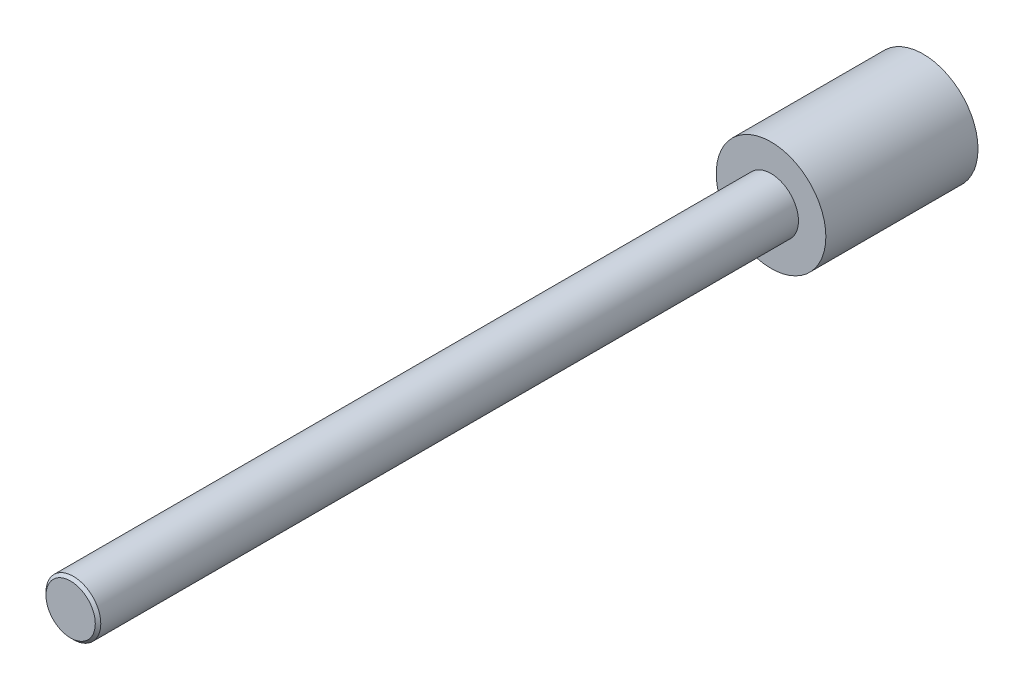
ISO-10303-21;
HEADER;
FILE_DESCRIPTION(('STEP AP214'),'2;1');
FILE_NAME('part.step','',(''),(''),'','','');
FILE_SCHEMA(('AUTOMOTIVE_DESIGN { 1 0 10303 214 1 1 1 1 }'));
ENDSEC;
DATA;
#1=APPLICATION_CONTEXT('core data for automotive mechanical design processes');
#2=APPLICATION_PROTOCOL_DEFINITION('international standard','automotive_design',2000,#1);
#3=PRODUCT_CONTEXT('',#1,'mechanical');
#4=PRODUCT('Part','Part','',(#3));
#5=PRODUCT_RELATED_PRODUCT_CATEGORY('part','',(#4));
#6=PRODUCT_DEFINITION_FORMATION('','',#4);
#7=PRODUCT_DEFINITION_CONTEXT('part definition',#1,'design');
#8=PRODUCT_DEFINITION('design','',#6,#7);
#9=PRODUCT_DEFINITION_SHAPE('','',#8);
#10=(LENGTH_UNIT() NAMED_UNIT(*) SI_UNIT(.MILLI.,.METRE.));
#11=(NAMED_UNIT(*) PLANE_ANGLE_UNIT() SI_UNIT($,.RADIAN.));
#12=(NAMED_UNIT(*) SI_UNIT($,.STERADIAN.) SOLID_ANGLE_UNIT());
#13=UNCERTAINTY_MEASURE_WITH_UNIT(LENGTH_MEASURE(1.E-05),#10,'distance_accuracy_value','');
#14=(GEOMETRIC_REPRESENTATION_CONTEXT(3) GLOBAL_UNCERTAINTY_ASSIGNED_CONTEXT((#13)) GLOBAL_UNIT_ASSIGNED_CONTEXT((#10,
#11,#12)) REPRESENTATION_CONTEXT('',''));
#15=CARTESIAN_POINT('',(0.,0.,0.));
#16=DIRECTION('',(0.,0.,1.));
#17=DIRECTION('',(1.,0.,0.));
#18=AXIS2_PLACEMENT_3D('',#15,#16,#17);
#19=CARTESIAN_POINT('',(0.,0.,13.843));
#20=DIRECTION('',(0.,0.,1.));
#21=DIRECTION('',(1.,0.,0.));
#22=AXIS2_PLACEMENT_3D('',#19,#20,#21);
#23=PLANE('',#22);
#24=CARTESIAN_POINT('',(0.,0.,13.843));
#25=DIRECTION('',(0.,0.,1.));
#26=DIRECTION('',(1.,0.,0.));
#27=AXIS2_PLACEMENT_3D('',#24,#25,#26);
#28=CIRCLE('',#27,5.08);
#29=CARTESIAN_POINT('',(5.08,0.,13.843));
#30=VERTEX_POINT('',#29);
#31=EDGE_CURVE('E45',#30,#30,#28,.T.);
#32=ORIENTED_EDGE('',*,*,#31,.T.);
#33=EDGE_LOOP('',(#32));
#34=FACE_BOUND('',#33,.T.);
#35=CARTESIAN_POINT('',(0.,0.,13.843));
#36=DIRECTION('',(0.,0.,1.));
#37=DIRECTION('',(1.,0.,0.));
#38=AXIS2_PLACEMENT_3D('',#35,#36,#37);
#39=CIRCLE('',#38,2.54);
#40=CARTESIAN_POINT('',(2.54,0.,13.843));
#41=VERTEX_POINT('',#40);
#42=EDGE_CURVE('E41',#41,#41,#39,.T.);
#43=ORIENTED_EDGE('',*,*,#42,.F.);
#44=EDGE_LOOP('',(#43));
#45=FACE_BOUND('',#44,.T.);
#46=ADVANCED_FACE('F30',(#34,#45),#23,.T.);
#47=CARTESIAN_POINT('',(0.,0.,13.843));
#48=DIRECTION('',(0.,0.,-1.));
#49=DIRECTION('',(-1.,0.,0.));
#50=AXIS2_PLACEMENT_3D('',#47,#48,#49);
#51=CYLINDRICAL_SURFACE('',#50,5.08);
#52=ORIENTED_EDGE('',*,*,#31,.F.);
#53=EDGE_LOOP('',(#52));
#54=FACE_BOUND('',#53,.T.);
#55=CARTESIAN_POINT('',(0.,0.,-0.254));
#56=DIRECTION('',(0.,0.,1.));
#57=DIRECTION('',(1.,0.,0.));
#58=AXIS2_PLACEMENT_3D('',#55,#56,#57);
#59=CIRCLE('',#58,5.08);
#60=CARTESIAN_POINT('',(5.08,0.,-0.254));
#61=VERTEX_POINT('',#60);
#62=EDGE_CURVE('E48',#61,#61,#59,.T.);
#63=ORIENTED_EDGE('',*,*,#62,.T.);
#64=EDGE_LOOP('',(#63));
#65=FACE_BOUND('',#64,.T.);
#66=ADVANCED_FACE('F56',(#54,#65),#51,.T.);
#67=CARTESIAN_POINT('',(0.,0.,-0.254));
#68=DIRECTION('',(0.,0.,1.));
#69=DIRECTION('',(1.,0.,0.));
#70=AXIS2_PLACEMENT_3D('',#67,#68,#69);
#71=PLANE('',#70);
#72=ORIENTED_EDGE('',*,*,#62,.F.);
#73=EDGE_LOOP('',(#72));
#74=FACE_BOUND('',#73,.T.);
#75=ADVANCED_FACE('F59',(#74),#71,.F.);
#76=CARTESIAN_POINT('',(0.,0.,78.74));
#77=DIRECTION('',(0.,0.,-1.));
#78=DIRECTION('',(-1.,0.,0.));
#79=AXIS2_PLACEMENT_3D('',#76,#77,#78);
#80=CYLINDRICAL_SURFACE('',#79,2.54);
#81=CARTESIAN_POINT('',(0.,0.,78.486));
#82=DIRECTION('',(0.,0.,1.));
#83=DIRECTION('',(1.,0.,0.));
#84=AXIS2_PLACEMENT_3D('',#81,#82,#83);
#85=CIRCLE('',#84,2.54);
#86=CARTESIAN_POINT('',(2.54,0.,78.486));
#87=VERTEX_POINT('',#86);
#88=EDGE_CURVE('E10',#87,#87,#85,.F.);
#89=ORIENTED_EDGE('',*,*,#88,.T.);
#90=EDGE_LOOP('',(#89));
#91=FACE_BOUND('',#90,.T.);
#92=ORIENTED_EDGE('',*,*,#42,.T.);
#93=EDGE_LOOP('',(#92));
#94=FACE_BOUND('',#93,.T.);
#95=ADVANCED_FACE('F64',(#91,#94),#80,.T.);
#96=CARTESIAN_POINT('',(0.,0.,78.74));
#97=DIRECTION('',(0.,0.,1.));
#98=DIRECTION('',(1.,0.,0.));
#99=AXIS2_PLACEMENT_3D('',#96,#97,#98);
#100=PLANE('',#99);
#101=CARTESIAN_POINT('',(0.,0.,78.74));
#102=DIRECTION('',(0.,0.,1.));
#103=DIRECTION('',(1.,0.,0.));
#104=AXIS2_PLACEMENT_3D('',#101,#102,#103);
#105=CIRCLE('',#104,2.286);
#106=CARTESIAN_POINT('',(2.286,0.,78.74));
#107=VERTEX_POINT('',#106);
#108=EDGE_CURVE('E37',#107,#107,#105,.T.);
#109=ORIENTED_EDGE('',*,*,#108,.T.);
#110=EDGE_LOOP('',(#109));
#111=FACE_BOUND('',#110,.T.);
#112=ADVANCED_FACE('F69',(#111),#100,.T.);
#113=CARTESIAN_POINT('',(0.,0.,78.74));
#114=DIRECTION('',(0.,0.,-1.));
#115=DIRECTION('',(-1.,0.,0.));
#116=AXIS2_PLACEMENT_3D('',#113,#114,#115);
#117=CONICAL_SURFACE('',#116,2.286,0.785398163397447);
#118=ORIENTED_EDGE('',*,*,#88,.F.);
#119=EDGE_LOOP('',(#118));
#120=FACE_BOUND('',#119,.T.);
#121=ORIENTED_EDGE('',*,*,#108,.F.);
#122=EDGE_LOOP('',(#121));
#123=FACE_BOUND('',#122,.T.);
#124=ADVANCED_FACE('F32',(#120,#123),#117,.T.);
#125=CLOSED_SHELL('',(#46,#66,#75,#95,#112,#124));
#126=MANIFOLD_SOLID_BREP('B2',#125);
#127=ADVANCED_BREP_SHAPE_REPRESENTATION('',(#18,#126),#14);
#128=SHAPE_DEFINITION_REPRESENTATION(#9,#127);
ENDSEC;
END-ISO-10303-21;
